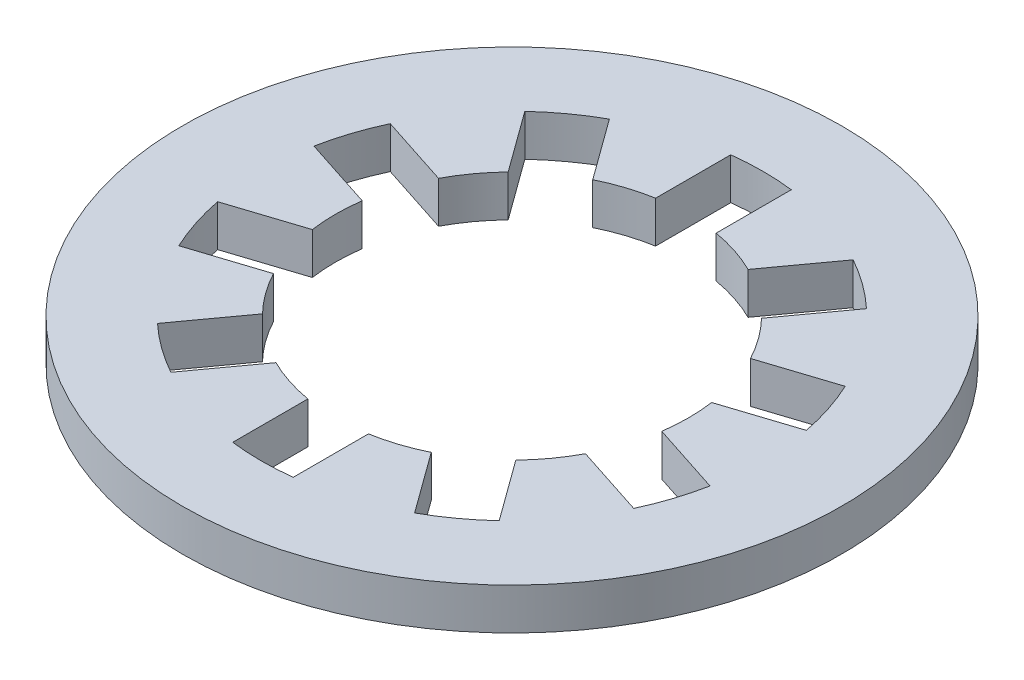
ISO-10303-21;
HEADER;
FILE_DESCRIPTION(('STEP AP214'),'2;1');
FILE_NAME('part.step','',(''),(''),'','','');
FILE_SCHEMA(('AUTOMOTIVE_DESIGN { 1 0 10303 214 1 1 1 1 }'));
ENDSEC;
DATA;
#1=APPLICATION_CONTEXT('core data for automotive mechanical design processes');
#2=APPLICATION_PROTOCOL_DEFINITION('international standard','automotive_design',2000,#1);
#3=PRODUCT_CONTEXT('',#1,'mechanical');
#4=PRODUCT('Part','Part','',(#3));
#5=PRODUCT_RELATED_PRODUCT_CATEGORY('part','',(#4));
#6=PRODUCT_DEFINITION_FORMATION('','',#4);
#7=PRODUCT_DEFINITION_CONTEXT('part definition',#1,'design');
#8=PRODUCT_DEFINITION('design','',#6,#7);
#9=PRODUCT_DEFINITION_SHAPE('','',#8);
#10=(LENGTH_UNIT() NAMED_UNIT(*) SI_UNIT(.MILLI.,.METRE.));
#11=(NAMED_UNIT(*) PLANE_ANGLE_UNIT() SI_UNIT($,.RADIAN.));
#12=(NAMED_UNIT(*) SI_UNIT($,.STERADIAN.) SOLID_ANGLE_UNIT());
#13=UNCERTAINTY_MEASURE_WITH_UNIT(LENGTH_MEASURE(1.E-05),#10,'distance_accuracy_value','');
#14=(GEOMETRIC_REPRESENTATION_CONTEXT(3) GLOBAL_UNCERTAINTY_ASSIGNED_CONTEXT((#13)) GLOBAL_UNIT_ASSIGNED_CONTEXT((#10,
#11,#12)) REPRESENTATION_CONTEXT('',''));
#15=CARTESIAN_POINT('',(0.,0.,0.));
#16=DIRECTION('',(0.,0.,1.));
#17=DIRECTION('',(1.,0.,0.));
#18=AXIS2_PLACEMENT_3D('',#15,#16,#17);
#19=CARTESIAN_POINT('',(0.,0.609600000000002,0.));
#20=DIRECTION('',(0.,-1.,0.));
#21=DIRECTION('',(0.,0.,-1.));
#22=AXIS2_PLACEMENT_3D('',#19,#20,#21);
#23=CYLINDRICAL_SURFACE('',#22,4.8387);
#24=CARTESIAN_POINT('',(0.,0.609600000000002,0.));
#25=DIRECTION('',(0.,1.,0.));
#26=DIRECTION('',(0.,0.,1.));
#27=AXIS2_PLACEMENT_3D('',#24,#25,#26);
#28=CIRCLE('',#27,4.8387);
#29=CARTESIAN_POINT('',(0.,0.609600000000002,4.8387));
#30=VERTEX_POINT('',#29);
#31=EDGE_CURVE('E11',#30,#30,#28,.T.);
#32=ORIENTED_EDGE('',*,*,#31,.F.);
#33=EDGE_LOOP('',(#32));
#34=FACE_BOUND('',#33,.T.);
#35=CARTESIAN_POINT('',(0.,0.,0.));
#36=DIRECTION('',(0.,1.,0.));
#37=DIRECTION('',(0.,0.,1.));
#38=AXIS2_PLACEMENT_3D('',#35,#36,#37);
#39=CIRCLE('',#38,4.8387);
#40=CARTESIAN_POINT('',(0.,0.,4.8387));
#41=VERTEX_POINT('',#40);
#42=EDGE_CURVE('E39',#41,#41,#39,.T.);
#43=ORIENTED_EDGE('',*,*,#42,.T.);
#44=EDGE_LOOP('',(#43));
#45=FACE_BOUND('',#44,.T.);
#46=ADVANCED_FACE('F36',(#34,#45),#23,.T.);
#47=CARTESIAN_POINT('',(0.,0.609600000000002,0.));
#48=DIRECTION('',(0.,1.,0.));
#49=DIRECTION('',(0.,0.,1.));
#50=AXIS2_PLACEMENT_3D('',#47,#48,#49);
#51=PLANE('',#50);
#52=CARTESIAN_POINT('',(0.,0.609600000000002,0.));
#53=DIRECTION('',(0.,1.,0.));
#54=DIRECTION('',(0.,0.,1.));
#55=AXIS2_PLACEMENT_3D('',#52,#53,#54);
#56=CIRCLE('',#55,2.5908);
#57=CARTESIAN_POINT('',(0.444499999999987,0.609600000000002,2.55238406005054));
#58=VERTEX_POINT('',#57);
#59=CARTESIAN_POINT('',(1.14064565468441,0.609600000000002,2.3261926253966));
#60=VERTEX_POINT('',#59);
#61=EDGE_CURVE('E295',#58,#60,#56,.T.);
#62=ORIENTED_EDGE('',*,*,#61,.F.);
#63=DIRECTION('',(0.,0.,-1.));
#64=VECTOR('',#63,1.);
#65=CARTESIAN_POINT('',(0.444499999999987,0.609600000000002,2.55238406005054));
#66=LINE('',#65,#64);
#67=CARTESIAN_POINT('',(0.444499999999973,0.609600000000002,3.65607832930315));
#68=VERTEX_POINT('',#67);
#69=EDGE_CURVE('E313',#68,#58,#66,.T.);
#70=ORIENTED_EDGE('',*,*,#69,.F.);
#71=CARTESIAN_POINT('',(0.,0.609600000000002,0.));
#72=DIRECTION('',(0.,1.,0.));
#73=DIRECTION('',(0.,0.,1.));
#74=AXIS2_PLACEMENT_3D('',#71,#72,#73);
#75=CIRCLE('',#74,3.683);
#76=CARTESIAN_POINT('',(-0.444500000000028,0.609600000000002,3.65607832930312));
#77=VERTEX_POINT('',#76);
#78=EDGE_CURVE('E324',#77,#68,#75,.T.);
#79=ORIENTED_EDGE('',*,*,#78,.F.);
#80=DIRECTION('',(0.,0.,1.));
#81=VECTOR('',#80,1.);
#82=CARTESIAN_POINT('',(-0.444500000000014,0.609600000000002,2.55238406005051));
#83=LINE('',#82,#81);
#84=CARTESIAN_POINT('',(-0.444500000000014,0.609600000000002,2.55238406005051));
#85=VERTEX_POINT('',#84);
#86=EDGE_CURVE('E331',#85,#77,#83,.T.);
#87=ORIENTED_EDGE('',*,*,#86,.F.);
#88=CARTESIAN_POINT('',(-1.14064565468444,0.609600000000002,2.3261926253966));
#89=VERTEX_POINT('',#88);
#90=EDGE_CURVE('E319',#89,#85,#56,.T.);
#91=ORIENTED_EDGE('',*,*,#90,.F.);
#92=DIRECTION('',(0.58778525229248,0.,-0.809016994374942));
#93=VECTOR('',#92,1.);
#94=CARTESIAN_POINT('',(-1.14064565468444,0.609600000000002,2.3261926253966));
#95=LINE('',#94,#93);
#96=CARTESIAN_POINT('',(-1.78938086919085,0.609600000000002,3.21910004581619));
#97=VERTEX_POINT('',#96);
#98=EDGE_CURVE('E677',#97,#89,#95,.T.);
#99=ORIENTED_EDGE('',*,*,#98,.F.);
#100=CARTESIAN_POINT('',(0.,0.609600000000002,0.));
#101=DIRECTION('',(0.,1.,0.));
#102=DIRECTION('',(0.,0.,1.));
#103=AXIS2_PLACEMENT_3D('',#100,#101,#102);
#104=CIRCLE('',#103,3.683);
#105=CARTESIAN_POINT('',(-2.50859697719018,0.609600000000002,2.69655895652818));
#106=VERTEX_POINT('',#105);
#107=EDGE_CURVE('E689',#106,#97,#104,.T.);
#108=ORIENTED_EDGE('',*,*,#107,.F.);
#109=DIRECTION('',(-0.58778525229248,0.,0.809016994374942));
#110=VECTOR('',#109,1.);
#111=CARTESIAN_POINT('',(-1.85986176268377,0.609600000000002,1.80365153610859));
#112=LINE('',#111,#110);
#113=CARTESIAN_POINT('',(-1.85986176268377,0.609600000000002,1.80365153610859));
#114=VERTEX_POINT('',#113);
#115=EDGE_CURVE('E662',#114,#106,#112,.T.);
#116=ORIENTED_EDGE('',*,*,#115,.F.);
#117=CARTESIAN_POINT('',(-2.29010343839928,0.609600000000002,1.21147467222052));
#118=VERTEX_POINT('',#117);
#119=EDGE_CURVE('E762',#118,#114,#56,.T.);
#120=ORIENTED_EDGE('',*,*,#119,.F.);
#121=DIRECTION('',(0.951056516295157,0.,-0.309016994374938));
#122=VECTOR('',#121,1.);
#123=CARTESIAN_POINT('',(-2.29010343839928,0.609600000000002,1.21147467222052));
#124=LINE('',#123,#122);
#125=CARTESIAN_POINT('',(-3.33977906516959,0.609600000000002,1.5525349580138));
#126=VERTEX_POINT('',#125);
#127=EDGE_CURVE('E640',#126,#118,#124,.T.);
#128=ORIENTED_EDGE('',*,*,#127,.F.);
#129=CARTESIAN_POINT('',(0.,0.609600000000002,0.));
#130=DIRECTION('',(0.,1.,0.));
#131=DIRECTION('',(0.,0.,1.));
#132=AXIS2_PLACEMENT_3D('',#129,#130,#131);
#133=CIRCLE('',#132,3.683);
#134=CARTESIAN_POINT('',(-3.61449517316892,0.609600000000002,0.707045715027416));
#135=VERTEX_POINT('',#134);
#136=EDGE_CURVE('E652',#135,#126,#133,.T.);
#137=ORIENTED_EDGE('',*,*,#136,.F.);
#138=DIRECTION('',(-0.951056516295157,0.,0.309016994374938));
#139=VECTOR('',#138,1.);
#140=CARTESIAN_POINT('',(-2.5648195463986,0.609600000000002,0.365985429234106));
#141=LINE('',#140,#139);
#142=CARTESIAN_POINT('',(-2.5648195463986,0.609600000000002,0.365985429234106));
#143=VERTEX_POINT('',#142);
#144=EDGE_CURVE('E625',#143,#135,#141,.T.);
#145=ORIENTED_EDGE('',*,*,#144,.F.);
#146=CARTESIAN_POINT('',(-2.56481954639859,0.609600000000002,-0.365985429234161));
#147=VERTEX_POINT('',#146);
#148=EDGE_CURVE('E757',#147,#143,#56,.T.);
#149=ORIENTED_EDGE('',*,*,#148,.F.);
#150=DIRECTION('',(0.95105651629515,0.,0.309016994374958));
#151=VECTOR('',#150,1.);
#152=CARTESIAN_POINT('',(-2.56481954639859,0.609600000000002,-0.365985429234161));
#153=LINE('',#152,#151);
#154=CARTESIAN_POINT('',(-3.61449517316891,0.609600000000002,-0.707045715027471));
#155=VERTEX_POINT('',#154);
#156=EDGE_CURVE('E603',#155,#147,#153,.T.);
#157=ORIENTED_EDGE('',*,*,#156,.F.);
#158=CARTESIAN_POINT('',(0.,0.609600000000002,0.));
#159=DIRECTION('',(0.,1.,0.));
#160=DIRECTION('',(0.,0.,1.));
#161=AXIS2_PLACEMENT_3D('',#158,#159,#160);
#162=CIRCLE('',#161,3.683);
#163=CARTESIAN_POINT('',(-3.33977906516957,0.609600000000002,-1.55253495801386));
#164=VERTEX_POINT('',#163);
#165=EDGE_CURVE('E615',#164,#155,#162,.T.);
#166=ORIENTED_EDGE('',*,*,#165,.F.);
#167=DIRECTION('',(-0.95105651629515,0.,-0.309016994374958));
#168=VECTOR('',#167,1.);
#169=CARTESIAN_POINT('',(-2.29010343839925,0.609600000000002,-1.21147467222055));
#170=LINE('',#169,#168);
#171=CARTESIAN_POINT('',(-2.29010343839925,0.609600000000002,-1.21147467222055));
#172=VERTEX_POINT('',#171);
#173=EDGE_CURVE('E589',#172,#164,#170,.T.);
#174=ORIENTED_EDGE('',*,*,#173,.F.);
#175=CARTESIAN_POINT('',(-1.85986176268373,0.609600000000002,-1.80365153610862));
#176=VERTEX_POINT('',#175);
#177=EDGE_CURVE('E761',#176,#172,#56,.T.);
#178=ORIENTED_EDGE('',*,*,#177,.F.);
#179=DIRECTION('',(0.587785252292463,0.,0.809016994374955));
#180=VECTOR('',#179,1.);
#181=CARTESIAN_POINT('',(-1.85986176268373,0.609600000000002,-1.80365153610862));
#182=LINE('',#181,#180);
#183=CARTESIAN_POINT('',(-2.50859697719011,0.609600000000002,-2.69655895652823));
#184=VERTEX_POINT('',#183);
#185=EDGE_CURVE('E568',#184,#176,#182,.T.);
#186=ORIENTED_EDGE('',*,*,#185,.F.);
#187=CARTESIAN_POINT('',(0.,0.609600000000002,0.));
#188=DIRECTION('',(0.,1.,0.));
#189=DIRECTION('',(0.,0.,1.));
#190=AXIS2_PLACEMENT_3D('',#187,#188,#189);
#191=CIRCLE('',#190,3.683);
#192=CARTESIAN_POINT('',(-1.78938086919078,0.609600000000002,-3.21910004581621));
#193=VERTEX_POINT('',#192);
#194=EDGE_CURVE('E579',#193,#184,#191,.T.);
#195=ORIENTED_EDGE('',*,*,#194,.F.);
#196=DIRECTION('',(-0.587785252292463,0.,-0.809016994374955));
#197=VECTOR('',#196,1.);
#198=CARTESIAN_POINT('',(-1.14064565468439,0.609600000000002,-2.32619262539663));
#199=LINE('',#198,#197);
#200=CARTESIAN_POINT('',(-1.14064565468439,0.609600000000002,-2.32619262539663));
#201=VERTEX_POINT('',#200);
#202=EDGE_CURVE('E562',#201,#193,#199,.T.);
#203=ORIENTED_EDGE('',*,*,#202,.F.);
#204=CARTESIAN_POINT('',(-0.4445,0.609600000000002,-2.55238406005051));
#205=VERTEX_POINT('',#204);
#206=EDGE_CURVE('E51',#205,#201,#56,.T.);
#207=ORIENTED_EDGE('',*,*,#206,.F.);
#208=DIRECTION('',(0.,0.,1.));
#209=VECTOR('',#208,1.);
#210=CARTESIAN_POINT('',(-0.4445,0.609600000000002,-2.55238406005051));
#211=LINE('',#210,#209);
#212=CARTESIAN_POINT('',(-0.4445,0.609600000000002,-3.65607832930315));
#213=VERTEX_POINT('',#212);
#214=EDGE_CURVE('E459',#213,#205,#211,.T.);
#215=ORIENTED_EDGE('',*,*,#214,.F.);
#216=CARTESIAN_POINT('',(0.,0.609600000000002,0.));
#217=DIRECTION('',(0.,1.,0.));
#218=DIRECTION('',(0.,0.,1.));
#219=AXIS2_PLACEMENT_3D('',#216,#217,#218);
#220=CIRCLE('',#219,3.683);
#221=CARTESIAN_POINT('',(0.4445,0.609600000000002,-3.65607832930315));
#222=VERTEX_POINT('',#221);
#223=EDGE_CURVE('E471',#222,#213,#220,.T.);
#224=ORIENTED_EDGE('',*,*,#223,.F.);
#225=DIRECTION('',(0.,0.,-1.));
#226=VECTOR('',#225,1.);
#227=CARTESIAN_POINT('',(0.4445,0.609600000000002,-2.55238406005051));
#228=LINE('',#227,#226);
#229=CARTESIAN_POINT('',(0.4445,0.609600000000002,-2.55238406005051));
#230=VERTEX_POINT('',#229);
#231=EDGE_CURVE('E444',#230,#222,#228,.T.);
#232=ORIENTED_EDGE('',*,*,#231,.F.);
#233=CARTESIAN_POINT('',(1.14064565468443,0.609600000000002,-2.3261926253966));
#234=VERTEX_POINT('',#233);
#235=EDGE_CURVE('E1212',#234,#230,#56,.T.);
#236=ORIENTED_EDGE('',*,*,#235,.F.);
#237=DIRECTION('',(-0.587785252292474,0.,0.809016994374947));
#238=VECTOR('',#237,1.);
#239=CARTESIAN_POINT('',(1.14064565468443,0.609600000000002,-2.3261926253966));
#240=LINE('',#239,#238);
#241=CARTESIAN_POINT('',(1.78938086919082,0.609600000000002,-3.21910004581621));
#242=VERTEX_POINT('',#241);
#243=EDGE_CURVE('E496',#242,#234,#240,.T.);
#244=ORIENTED_EDGE('',*,*,#243,.F.);
#245=CARTESIAN_POINT('',(0.,0.609600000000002,0.));
#246=DIRECTION('',(0.,1.,0.));
#247=DIRECTION('',(0.,0.,1.));
#248=AXIS2_PLACEMENT_3D('',#245,#246,#247);
#249=CIRCLE('',#248,3.683);
#250=CARTESIAN_POINT('',(2.50859697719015,0.609600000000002,-2.69655895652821));
#251=VERTEX_POINT('',#250);
#252=EDGE_CURVE('E508',#251,#242,#249,.T.);
#253=ORIENTED_EDGE('',*,*,#252,.F.);
#254=DIRECTION('',(0.587785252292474,0.,-0.809016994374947));
#255=VECTOR('',#254,1.);
#256=CARTESIAN_POINT('',(1.85986176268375,0.609600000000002,-1.80365153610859));
#257=LINE('',#256,#255);
#258=CARTESIAN_POINT('',(1.85986176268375,0.609600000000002,-1.80365153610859));
#259=VERTEX_POINT('',#258);
#260=EDGE_CURVE('E481',#259,#251,#257,.T.);
#261=ORIENTED_EDGE('',*,*,#260,.F.);
#262=CARTESIAN_POINT('',(2.29010343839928,0.609600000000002,-1.21147467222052));
#263=VERTEX_POINT('',#262);
#264=EDGE_CURVE('E536',#263,#259,#56,.T.);
#265=ORIENTED_EDGE('',*,*,#264,.F.);
#266=DIRECTION('',(-0.951056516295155,0.,0.309016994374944));
#267=VECTOR('',#266,1.);
#268=CARTESIAN_POINT('',(2.29010343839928,0.609600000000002,-1.21147467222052));
#269=LINE('',#268,#267);
#270=CARTESIAN_POINT('',(3.33977906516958,0.609600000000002,-1.55253495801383));
#271=VERTEX_POINT('',#270);
#272=EDGE_CURVE('E422',#271,#263,#269,.T.);
#273=ORIENTED_EDGE('',*,*,#272,.F.);
#274=CARTESIAN_POINT('',(0.,0.609600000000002,0.));
#275=DIRECTION('',(0.,1.,0.));
#276=DIRECTION('',(0.,0.,1.));
#277=AXIS2_PLACEMENT_3D('',#274,#275,#276);
#278=CIRCLE('',#277,3.683);
#279=CARTESIAN_POINT('',(3.61449517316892,0.609600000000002,-0.707045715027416));
#280=VERTEX_POINT('',#279);
#281=EDGE_CURVE('E434',#280,#271,#278,.T.);
#282=ORIENTED_EDGE('',*,*,#281,.F.);
#283=DIRECTION('',(0.951056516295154,0.,-0.309016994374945));
#284=VECTOR('',#283,1.);
#285=CARTESIAN_POINT('',(2.5648195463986,0.609600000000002,-0.365985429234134));
#286=LINE('',#285,#284);
#287=CARTESIAN_POINT('',(2.5648195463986,0.609600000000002,-0.365985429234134));
#288=VERTEX_POINT('',#287);
#289=EDGE_CURVE('E407',#288,#280,#286,.T.);
#290=ORIENTED_EDGE('',*,*,#289,.F.);
#291=CARTESIAN_POINT('',(2.56481954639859,0.609600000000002,0.365985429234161));
#292=VERTEX_POINT('',#291);
#293=EDGE_CURVE('E1226',#292,#288,#56,.T.);
#294=ORIENTED_EDGE('',*,*,#293,.F.);
#295=DIRECTION('',(-0.951056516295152,0.,-0.309016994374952));
#296=VECTOR('',#295,1.);
#297=CARTESIAN_POINT('',(2.56481954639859,0.609600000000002,0.365985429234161));
#298=LINE('',#297,#296);
#299=CARTESIAN_POINT('',(3.61449517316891,0.609600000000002,0.707045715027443));
#300=VERTEX_POINT('',#299);
#301=EDGE_CURVE('E385',#300,#292,#298,.T.);
#302=ORIENTED_EDGE('',*,*,#301,.F.);
#303=CARTESIAN_POINT('',(0.,0.609600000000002,0.));
#304=DIRECTION('',(0.,1.,0.));
#305=DIRECTION('',(0.,0.,1.));
#306=AXIS2_PLACEMENT_3D('',#303,#304,#305);
#307=CIRCLE('',#306,3.683);
#308=CARTESIAN_POINT('',(3.33977906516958,0.609600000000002,1.55253495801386));
#309=VERTEX_POINT('',#308);
#310=EDGE_CURVE('E397',#309,#300,#307,.T.);
#311=ORIENTED_EDGE('',*,*,#310,.F.);
#312=DIRECTION('',(0.951056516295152,0.,0.309016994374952));
#313=VECTOR('',#312,1.);
#314=CARTESIAN_POINT('',(2.29010343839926,0.609600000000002,1.21147467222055));
#315=LINE('',#314,#313);
#316=CARTESIAN_POINT('',(2.29010343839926,0.609600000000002,1.21147467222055));
#317=VERTEX_POINT('',#316);
#318=EDGE_CURVE('E371',#317,#309,#315,.T.);
#319=ORIENTED_EDGE('',*,*,#318,.F.);
#320=CARTESIAN_POINT('',(1.85986176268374,0.609600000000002,1.80365153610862));
#321=VERTEX_POINT('',#320);
#322=EDGE_CURVE('E317',#321,#317,#56,.T.);
#323=ORIENTED_EDGE('',*,*,#322,.F.);
#324=DIRECTION('',(-0.587785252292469,0.,-0.809016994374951));
#325=VECTOR('',#324,1.);
#326=CARTESIAN_POINT('',(1.85986176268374,0.609600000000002,1.80365153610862));
#327=LINE('',#326,#325);
#328=CARTESIAN_POINT('',(2.50859697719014,0.609600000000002,2.69655895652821));
#329=VERTEX_POINT('',#328);
#330=EDGE_CURVE('E350',#329,#321,#327,.T.);
#331=ORIENTED_EDGE('',*,*,#330,.F.);
#332=CARTESIAN_POINT('',(0.,0.609600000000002,0.));
#333=DIRECTION('',(0.,1.,0.));
#334=DIRECTION('',(0.,0.,1.));
#335=AXIS2_PLACEMENT_3D('',#332,#333,#334);
#336=CIRCLE('',#335,3.683);
#337=CARTESIAN_POINT('',(1.78938086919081,0.609600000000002,3.21910004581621));
#338=VERTEX_POINT('',#337);
#339=EDGE_CURVE('E361',#338,#329,#336,.T.);
#340=ORIENTED_EDGE('',*,*,#339,.F.);
#341=DIRECTION('',(0.587785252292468,0.,0.809016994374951));
#342=VECTOR('',#341,1.);
#343=CARTESIAN_POINT('',(1.14064565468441,0.609600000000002,2.3261926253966));
#344=LINE('',#343,#342);
#345=EDGE_CURVE('E304',#60,#338,#344,.T.);
#346=ORIENTED_EDGE('',*,*,#345,.F.);
#347=EDGE_LOOP('',(#62,#70,#79,#87,#91,#99,#108,#116,#120,#128,#137,#145,#149,#157,#166,#174,
#178,#186,#195,#203,#207,#215,#224,#232,#236,#244,#253,#261,#265,#273,#282,#290,#294,#302,#311,
#319,#323,#331,#340,#346));
#348=FACE_BOUND('',#347,.T.);
#349=ORIENTED_EDGE('',*,*,#31,.T.);
#350=EDGE_LOOP('',(#349));
#351=FACE_BOUND('',#350,.T.);
#352=ADVANCED_FACE('F310',(#348,#351),#51,.T.);
#353=CARTESIAN_POINT('',(0.,0.,0.));
#354=DIRECTION('',(0.,1.,0.));
#355=DIRECTION('',(0.,0.,1.));
#356=AXIS2_PLACEMENT_3D('',#353,#354,#355);
#357=PLANE('',#356);
#358=DIRECTION('',(0.,0.,-1.));
#359=VECTOR('',#358,1.);
#360=CARTESIAN_POINT('',(0.444499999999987,0.,2.55238406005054));
#361=LINE('',#360,#359);
#362=CARTESIAN_POINT('',(0.444499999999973,0.,3.65607832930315));
#363=VERTEX_POINT('',#362);
#364=CARTESIAN_POINT('',(0.444499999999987,0.,2.55238406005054));
#365=VERTEX_POINT('',#364);
#366=EDGE_CURVE('E344',#363,#365,#361,.T.);
#367=ORIENTED_EDGE('',*,*,#366,.T.);
#368=CARTESIAN_POINT('',(0.,0.,0.));
#369=DIRECTION('',(0.,1.,0.));
#370=DIRECTION('',(0.,0.,1.));
#371=AXIS2_PLACEMENT_3D('',#368,#369,#370);
#372=CIRCLE('',#371,2.5908);
#373=CARTESIAN_POINT('',(1.14064565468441,0.,2.3261926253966));
#374=VERTEX_POINT('',#373);
#375=EDGE_CURVE('E298',#365,#374,#372,.T.);
#376=ORIENTED_EDGE('',*,*,#375,.T.);
#377=DIRECTION('',(0.587785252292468,0.,0.809016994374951));
#378=VECTOR('',#377,1.);
#379=CARTESIAN_POINT('',(1.14064565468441,0.,2.3261926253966));
#380=LINE('',#379,#378);
#381=CARTESIAN_POINT('',(1.78938086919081,0.,3.21910004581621));
#382=VERTEX_POINT('',#381);
#383=EDGE_CURVE('E345',#374,#382,#380,.T.);
#384=ORIENTED_EDGE('',*,*,#383,.T.);
#385=CARTESIAN_POINT('',(0.,0.,0.));
#386=DIRECTION('',(0.,1.,0.));
#387=DIRECTION('',(0.,0.,1.));
#388=AXIS2_PLACEMENT_3D('',#385,#386,#387);
#389=CIRCLE('',#388,3.683);
#390=CARTESIAN_POINT('',(2.50859697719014,0.,2.69655895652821));
#391=VERTEX_POINT('',#390);
#392=EDGE_CURVE('E349',#382,#391,#389,.T.);
#393=ORIENTED_EDGE('',*,*,#392,.T.);
#394=DIRECTION('',(-0.587785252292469,0.,-0.809016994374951));
#395=VECTOR('',#394,1.);
#396=CARTESIAN_POINT('',(1.85986176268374,0.,1.80365153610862));
#397=LINE('',#396,#395);
#398=CARTESIAN_POINT('',(1.85986176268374,0.,1.80365153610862));
#399=VERTEX_POINT('',#398);
#400=EDGE_CURVE('E354',#391,#399,#397,.T.);
#401=ORIENTED_EDGE('',*,*,#400,.T.);
#402=CARTESIAN_POINT('',(2.29010343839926,0.,1.21147467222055));
#403=VERTEX_POINT('',#402);
#404=EDGE_CURVE('E557',#399,#403,#372,.T.);
#405=ORIENTED_EDGE('',*,*,#404,.T.);
#406=DIRECTION('',(0.951056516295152,0.,0.309016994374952));
#407=VECTOR('',#406,1.);
#408=CARTESIAN_POINT('',(2.29010343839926,0.,1.21147467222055));
#409=LINE('',#408,#407);
#410=CARTESIAN_POINT('',(3.33977906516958,0.,1.55253495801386));
#411=VERTEX_POINT('',#410);
#412=EDGE_CURVE('E380',#403,#411,#409,.T.);
#413=ORIENTED_EDGE('',*,*,#412,.T.);
#414=CARTESIAN_POINT('',(0.,0.,0.));
#415=DIRECTION('',(0.,1.,0.));
#416=DIRECTION('',(0.,0.,1.));
#417=AXIS2_PLACEMENT_3D('',#414,#415,#416);
#418=CIRCLE('',#417,3.683);
#419=CARTESIAN_POINT('',(3.61449517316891,0.,0.707045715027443));
#420=VERTEX_POINT('',#419);
#421=EDGE_CURVE('E384',#411,#420,#418,.T.);
#422=ORIENTED_EDGE('',*,*,#421,.T.);
#423=DIRECTION('',(-0.951056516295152,0.,-0.309016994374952));
#424=VECTOR('',#423,1.);
#425=CARTESIAN_POINT('',(2.56481954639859,0.,0.365985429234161));
#426=LINE('',#425,#424);
#427=CARTESIAN_POINT('',(2.56481954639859,0.,0.365985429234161));
#428=VERTEX_POINT('',#427);
#429=EDGE_CURVE('E389',#420,#428,#426,.T.);
#430=ORIENTED_EDGE('',*,*,#429,.T.);
#431=CARTESIAN_POINT('',(2.56481954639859,0.,-0.365985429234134));
#432=VERTEX_POINT('',#431);
#433=EDGE_CURVE('E550',#428,#432,#372,.T.);
#434=ORIENTED_EDGE('',*,*,#433,.T.);
#435=DIRECTION('',(0.951056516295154,0.,-0.309016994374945));
#436=VECTOR('',#435,1.);
#437=CARTESIAN_POINT('',(2.5648195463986,0.,-0.365985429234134));
#438=LINE('',#437,#436);
#439=CARTESIAN_POINT('',(3.61449517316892,0.,-0.707045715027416));
#440=VERTEX_POINT('',#439);
#441=EDGE_CURVE('E417',#432,#440,#438,.T.);
#442=ORIENTED_EDGE('',*,*,#441,.T.);
#443=CARTESIAN_POINT('',(0.,0.,0.));
#444=DIRECTION('',(0.,1.,0.));
#445=DIRECTION('',(0.,0.,1.));
#446=AXIS2_PLACEMENT_3D('',#443,#444,#445);
#447=CIRCLE('',#446,3.683);
#448=CARTESIAN_POINT('',(3.33977906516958,0.,-1.55253495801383));
#449=VERTEX_POINT('',#448);
#450=EDGE_CURVE('E421',#440,#449,#447,.T.);
#451=ORIENTED_EDGE('',*,*,#450,.T.);
#452=DIRECTION('',(-0.951056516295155,0.,0.309016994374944));
#453=VECTOR('',#452,1.);
#454=CARTESIAN_POINT('',(2.29010343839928,0.,-1.21147467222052));
#455=LINE('',#454,#453);
#456=CARTESIAN_POINT('',(2.29010343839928,0.,-1.21147467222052));
#457=VERTEX_POINT('',#456);
#458=EDGE_CURVE('E426',#449,#457,#455,.T.);
#459=ORIENTED_EDGE('',*,*,#458,.T.);
#460=CARTESIAN_POINT('',(1.85986176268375,0.,-1.80365153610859));
#461=VERTEX_POINT('',#460);
#462=EDGE_CURVE('E545',#457,#461,#372,.T.);
#463=ORIENTED_EDGE('',*,*,#462,.T.);
#464=DIRECTION('',(0.587785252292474,0.,-0.809016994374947));
#465=VECTOR('',#464,1.);
#466=CARTESIAN_POINT('',(1.85986176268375,0.,-1.80365153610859));
#467=LINE('',#466,#465);
#468=CARTESIAN_POINT('',(2.50859697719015,0.,-2.69655895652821));
#469=VERTEX_POINT('',#468);
#470=EDGE_CURVE('E491',#461,#469,#467,.T.);
#471=ORIENTED_EDGE('',*,*,#470,.T.);
#472=CARTESIAN_POINT('',(0.,0.,0.));
#473=DIRECTION('',(0.,1.,0.));
#474=DIRECTION('',(0.,0.,1.));
#475=AXIS2_PLACEMENT_3D('',#472,#473,#474);
#476=CIRCLE('',#475,3.683);
#477=CARTESIAN_POINT('',(1.78938086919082,0.,-3.21910004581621));
#478=VERTEX_POINT('',#477);
#479=EDGE_CURVE('E495',#469,#478,#476,.T.);
#480=ORIENTED_EDGE('',*,*,#479,.T.);
#481=DIRECTION('',(-0.587785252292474,0.,0.809016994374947));
#482=VECTOR('',#481,1.);
#483=CARTESIAN_POINT('',(1.14064565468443,0.,-2.3261926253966));
#484=LINE('',#483,#482);
#485=CARTESIAN_POINT('',(1.14064565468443,0.,-2.3261926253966));
#486=VERTEX_POINT('',#485);
#487=EDGE_CURVE('E500',#478,#486,#484,.T.);
#488=ORIENTED_EDGE('',*,*,#487,.T.);
#489=CARTESIAN_POINT('',(0.4445,0.,-2.55238406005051));
#490=VERTEX_POINT('',#489);
#491=EDGE_CURVE('E549',#486,#490,#372,.T.);
#492=ORIENTED_EDGE('',*,*,#491,.T.);
#493=DIRECTION('',(0.,0.,-1.));
#494=VECTOR('',#493,1.);
#495=CARTESIAN_POINT('',(0.4445,0.,-2.55238406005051));
#496=LINE('',#495,#494);
#497=CARTESIAN_POINT('',(0.4445,0.,-3.65607832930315));
#498=VERTEX_POINT('',#497);
#499=EDGE_CURVE('E454',#490,#498,#496,.T.);
#500=ORIENTED_EDGE('',*,*,#499,.T.);
#501=CARTESIAN_POINT('',(0.,0.,0.));
#502=DIRECTION('',(0.,1.,0.));
#503=DIRECTION('',(0.,0.,1.));
#504=AXIS2_PLACEMENT_3D('',#501,#502,#503);
#505=CIRCLE('',#504,3.683);
#506=CARTESIAN_POINT('',(-0.4445,0.,-3.65607832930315));
#507=VERTEX_POINT('',#506);
#508=EDGE_CURVE('E458',#498,#507,#505,.T.);
#509=ORIENTED_EDGE('',*,*,#508,.T.);
#510=DIRECTION('',(0.,0.,1.));
#511=VECTOR('',#510,1.);
#512=CARTESIAN_POINT('',(-0.4445,0.,-2.55238406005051));
#513=LINE('',#512,#511);
#514=CARTESIAN_POINT('',(-0.4445,0.,-2.55238406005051));
#515=VERTEX_POINT('',#514);
#516=EDGE_CURVE('E463',#507,#515,#513,.T.);
#517=ORIENTED_EDGE('',*,*,#516,.T.);
#518=CARTESIAN_POINT('',(-1.14064565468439,0.,-2.32619262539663));
#519=VERTEX_POINT('',#518);
#520=EDGE_CURVE('E558',#515,#519,#372,.T.);
#521=ORIENTED_EDGE('',*,*,#520,.T.);
#522=DIRECTION('',(-0.587785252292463,0.,-0.809016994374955));
#523=VECTOR('',#522,1.);
#524=CARTESIAN_POINT('',(-1.14064565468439,0.,-2.32619262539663));
#525=LINE('',#524,#523);
#526=CARTESIAN_POINT('',(-1.78938086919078,0.,-3.21910004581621));
#527=VERTEX_POINT('',#526);
#528=EDGE_CURVE('E564',#519,#527,#525,.T.);
#529=ORIENTED_EDGE('',*,*,#528,.T.);
#530=CARTESIAN_POINT('',(0.,0.,0.));
#531=DIRECTION('',(0.,1.,0.));
#532=DIRECTION('',(0.,0.,1.));
#533=AXIS2_PLACEMENT_3D('',#530,#531,#532);
#534=CIRCLE('',#533,3.683);
#535=CARTESIAN_POINT('',(-2.50859697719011,0.,-2.69655895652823));
#536=VERTEX_POINT('',#535);
#537=EDGE_CURVE('E59',#527,#536,#534,.T.);
#538=ORIENTED_EDGE('',*,*,#537,.T.);
#539=DIRECTION('',(0.587785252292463,0.,0.809016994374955));
#540=VECTOR('',#539,1.);
#541=CARTESIAN_POINT('',(-1.85986176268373,0.,-1.80365153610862));
#542=LINE('',#541,#540);
#543=CARTESIAN_POINT('',(-1.85986176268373,0.,-1.80365153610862));
#544=VERTEX_POINT('',#543);
#545=EDGE_CURVE('E571',#536,#544,#542,.T.);
#546=ORIENTED_EDGE('',*,*,#545,.T.);
#547=CARTESIAN_POINT('',(-2.29010343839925,0.,-1.21147467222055));
#548=VERTEX_POINT('',#547);
#549=EDGE_CURVE('E563',#544,#548,#372,.T.);
#550=ORIENTED_EDGE('',*,*,#549,.T.);
#551=DIRECTION('',(-0.95105651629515,0.,-0.309016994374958));
#552=VECTOR('',#551,1.);
#553=CARTESIAN_POINT('',(-2.29010343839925,0.,-1.21147467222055));
#554=LINE('',#553,#552);
#555=CARTESIAN_POINT('',(-3.33977906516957,0.,-1.55253495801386));
#556=VERTEX_POINT('',#555);
#557=EDGE_CURVE('E598',#548,#556,#554,.T.);
#558=ORIENTED_EDGE('',*,*,#557,.T.);
#559=CARTESIAN_POINT('',(0.,0.,0.));
#560=DIRECTION('',(0.,1.,0.));
#561=DIRECTION('',(0.,0.,1.));
#562=AXIS2_PLACEMENT_3D('',#559,#560,#561);
#563=CIRCLE('',#562,3.683);
#564=CARTESIAN_POINT('',(-3.61449517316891,0.,-0.707045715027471));
#565=VERTEX_POINT('',#564);
#566=EDGE_CURVE('E602',#556,#565,#563,.T.);
#567=ORIENTED_EDGE('',*,*,#566,.T.);
#568=DIRECTION('',(0.95105651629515,0.,0.309016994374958));
#569=VECTOR('',#568,1.);
#570=CARTESIAN_POINT('',(-2.56481954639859,0.,-0.365985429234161));
#571=LINE('',#570,#569);
#572=CARTESIAN_POINT('',(-2.56481954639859,0.,-0.365985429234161));
#573=VERTEX_POINT('',#572);
#574=EDGE_CURVE('E607',#565,#573,#571,.T.);
#575=ORIENTED_EDGE('',*,*,#574,.T.);
#576=CARTESIAN_POINT('',(-2.5648195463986,0.,0.365985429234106));
#577=VERTEX_POINT('',#576);
#578=EDGE_CURVE('E731',#573,#577,#372,.T.);
#579=ORIENTED_EDGE('',*,*,#578,.T.);
#580=DIRECTION('',(-0.951056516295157,0.,0.309016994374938));
#581=VECTOR('',#580,1.);
#582=CARTESIAN_POINT('',(-2.5648195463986,0.,0.365985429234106));
#583=LINE('',#582,#581);
#584=CARTESIAN_POINT('',(-3.61449517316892,0.,0.707045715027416));
#585=VERTEX_POINT('',#584);
#586=EDGE_CURVE('E635',#577,#585,#583,.T.);
#587=ORIENTED_EDGE('',*,*,#586,.T.);
#588=CARTESIAN_POINT('',(0.,0.,0.));
#589=DIRECTION('',(0.,1.,0.));
#590=DIRECTION('',(0.,0.,1.));
#591=AXIS2_PLACEMENT_3D('',#588,#589,#590);
#592=CIRCLE('',#591,3.683);
#593=CARTESIAN_POINT('',(-3.33977906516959,0.,1.5525349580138));
#594=VERTEX_POINT('',#593);
#595=EDGE_CURVE('E639',#585,#594,#592,.T.);
#596=ORIENTED_EDGE('',*,*,#595,.T.);
#597=DIRECTION('',(0.951056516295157,0.,-0.309016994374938));
#598=VECTOR('',#597,1.);
#599=CARTESIAN_POINT('',(-2.29010343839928,0.,1.21147467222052));
#600=LINE('',#599,#598);
#601=CARTESIAN_POINT('',(-2.29010343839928,0.,1.21147467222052));
#602=VERTEX_POINT('',#601);
#603=EDGE_CURVE('E644',#594,#602,#600,.T.);
#604=ORIENTED_EDGE('',*,*,#603,.T.);
#605=CARTESIAN_POINT('',(-1.85986176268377,0.,1.80365153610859));
#606=VERTEX_POINT('',#605);
#607=EDGE_CURVE('E728',#602,#606,#372,.T.);
#608=ORIENTED_EDGE('',*,*,#607,.T.);
#609=DIRECTION('',(-0.58778525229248,0.,0.809016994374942));
#610=VECTOR('',#609,1.);
#611=CARTESIAN_POINT('',(-1.85986176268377,0.,1.80365153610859));
#612=LINE('',#611,#610);
#613=CARTESIAN_POINT('',(-2.50859697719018,0.,2.69655895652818));
#614=VERTEX_POINT('',#613);
#615=EDGE_CURVE('E672',#606,#614,#612,.T.);
#616=ORIENTED_EDGE('',*,*,#615,.T.);
#617=CARTESIAN_POINT('',(0.,0.,0.));
#618=DIRECTION('',(0.,1.,0.));
#619=DIRECTION('',(0.,0.,1.));
#620=AXIS2_PLACEMENT_3D('',#617,#618,#619);
#621=CIRCLE('',#620,3.683);
#622=CARTESIAN_POINT('',(-1.78938086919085,0.,3.21910004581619));
#623=VERTEX_POINT('',#622);
#624=EDGE_CURVE('E676',#614,#623,#621,.T.);
#625=ORIENTED_EDGE('',*,*,#624,.T.);
#626=DIRECTION('',(0.58778525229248,0.,-0.809016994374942));
#627=VECTOR('',#626,1.);
#628=CARTESIAN_POINT('',(-1.14064565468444,0.,2.3261926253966));
#629=LINE('',#628,#627);
#630=CARTESIAN_POINT('',(-1.14064565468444,0.,2.3261926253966));
#631=VERTEX_POINT('',#630);
#632=EDGE_CURVE('E681',#623,#631,#629,.T.);
#633=ORIENTED_EDGE('',*,*,#632,.T.);
#634=CARTESIAN_POINT('',(-0.444500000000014,0.,2.55238406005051));
#635=VERTEX_POINT('',#634);
#636=EDGE_CURVE('E554',#631,#635,#372,.T.);
#637=ORIENTED_EDGE('',*,*,#636,.T.);
#638=DIRECTION('',(0.,0.,1.));
#639=VECTOR('',#638,1.);
#640=CARTESIAN_POINT('',(-0.444500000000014,0.,2.55238406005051));
#641=LINE('',#640,#639);
#642=CARTESIAN_POINT('',(-0.444500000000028,0.,3.65607832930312));
#643=VERTEX_POINT('',#642);
#644=EDGE_CURVE('E323',#635,#643,#641,.T.);
#645=ORIENTED_EDGE('',*,*,#644,.T.);
#646=CARTESIAN_POINT('',(0.,0.,0.));
#647=DIRECTION('',(0.,1.,0.));
#648=DIRECTION('',(0.,0.,1.));
#649=AXIS2_PLACEMENT_3D('',#646,#647,#648);
#650=CIRCLE('',#649,3.683);
#651=EDGE_CURVE('E329',#643,#363,#650,.T.);
#652=ORIENTED_EDGE('',*,*,#651,.T.);
#653=EDGE_LOOP('',(#367,#376,#384,#393,#401,#405,#413,#422,#430,#434,#442,#451,#459,#463,#471,
#480,#488,#492,#500,#509,#517,#521,#529,#538,#546,#550,#558,#567,#575,#579,#587,#596,#604,#608,
#616,#625,#633,#637,#645,#652));
#654=FACE_BOUND('',#653,.T.);
#655=ORIENTED_EDGE('',*,*,#42,.F.);
#656=EDGE_LOOP('',(#655));
#657=FACE_BOUND('',#656,.T.);
#658=ADVANCED_FACE('F543',(#654,#657),#357,.F.);
#659=CARTESIAN_POINT('',(1.14064565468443,0.,-2.3261926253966));
#660=DIRECTION('',(-0.809016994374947,0.,-0.587785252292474));
#661=DIRECTION('',(-0.587785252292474,0.,0.809016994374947));
#662=AXIS2_PLACEMENT_3D('',#659,#660,#661);
#663=PLANE('',#662);
#664=ORIENTED_EDGE('',*,*,#243,.T.);
#665=DIRECTION('',(0.,1.,0.));
#666=VECTOR('',#665,1.);
#667=CARTESIAN_POINT('',(1.14064565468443,0.,-2.3261926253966));
#668=LINE('',#667,#666);
#669=EDGE_CURVE('E515',#486,#234,#668,.T.);
#670=ORIENTED_EDGE('',*,*,#669,.F.);
#671=ORIENTED_EDGE('',*,*,#487,.F.);
#672=DIRECTION('',(0.,1.,0.));
#673=VECTOR('',#672,1.);
#674=CARTESIAN_POINT('',(1.78938086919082,0.,-3.21910004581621));
#675=LINE('',#674,#673);
#676=EDGE_CURVE('E518',#478,#242,#675,.T.);
#677=ORIENTED_EDGE('',*,*,#676,.T.);
#678=EDGE_LOOP('',(#664,#670,#671,#677));
#679=FACE_BOUND('',#678,.T.);
#680=ADVANCED_FACE('F810',(#679),#663,.F.);
#681=CARTESIAN_POINT('',(0.,0.,0.));
#682=DIRECTION('',(0.,1.,0.));
#683=DIRECTION('',(0.,0.,1.));
#684=AXIS2_PLACEMENT_3D('',#681,#682,#683);
#685=CYLINDRICAL_SURFACE('',#684,3.683);
#686=ORIENTED_EDGE('',*,*,#252,.T.);
#687=ORIENTED_EDGE('',*,*,#676,.F.);
#688=ORIENTED_EDGE('',*,*,#479,.F.);
#689=DIRECTION('',(0.,1.,0.));
#690=VECTOR('',#689,1.);
#691=CARTESIAN_POINT('',(2.50859697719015,0.,-2.69655895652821));
#692=LINE('',#691,#690);
#693=EDGE_CURVE('E521',#469,#251,#692,.T.);
#694=ORIENTED_EDGE('',*,*,#693,.T.);
#695=EDGE_LOOP('',(#686,#687,#688,#694));
#696=FACE_BOUND('',#695,.T.);
#697=ADVANCED_FACE('F540',(#696),#685,.F.);
#698=CARTESIAN_POINT('',(1.85986176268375,0.,-1.80365153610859));
#699=DIRECTION('',(0.809016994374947,0.,0.587785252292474));
#700=DIRECTION('',(0.587785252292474,0.,-0.809016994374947));
#701=AXIS2_PLACEMENT_3D('',#698,#699,#700);
#702=PLANE('',#701);
#703=ORIENTED_EDGE('',*,*,#260,.T.);
#704=ORIENTED_EDGE('',*,*,#693,.F.);
#705=ORIENTED_EDGE('',*,*,#470,.F.);
#706=DIRECTION('',(0.,1.,0.));
#707=VECTOR('',#706,1.);
#708=CARTESIAN_POINT('',(1.85986176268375,0.,-1.80365153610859));
#709=LINE('',#708,#707);
#710=EDGE_CURVE('E504',#461,#259,#709,.T.);
#711=ORIENTED_EDGE('',*,*,#710,.T.);
#712=EDGE_LOOP('',(#703,#704,#705,#711));
#713=FACE_BOUND('',#712,.T.);
#714=ADVANCED_FACE('F529',(#713),#702,.F.);
#715=CARTESIAN_POINT('',(-0.4445,0.,-2.55238406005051));
#716=DIRECTION('',(-1.,0.,0.));
#717=DIRECTION('',(0.,0.,1.));
#718=AXIS2_PLACEMENT_3D('',#715,#716,#717);
#719=PLANE('',#718);
#720=ORIENTED_EDGE('',*,*,#214,.T.);
#721=DIRECTION('',(0.,1.,0.));
#722=VECTOR('',#721,1.);
#723=CARTESIAN_POINT('',(-0.4445,0.,-2.55238406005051));
#724=LINE('',#723,#722);
#725=EDGE_CURVE('E478',#515,#205,#724,.T.);
#726=ORIENTED_EDGE('',*,*,#725,.F.);
#727=ORIENTED_EDGE('',*,*,#516,.F.);
#728=DIRECTION('',(0.,1.,0.));
#729=VECTOR('',#728,1.);
#730=CARTESIAN_POINT('',(-0.4445,0.,-3.65607832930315));
#731=LINE('',#730,#729);
#732=EDGE_CURVE('E482',#507,#213,#731,.T.);
#733=ORIENTED_EDGE('',*,*,#732,.T.);
#734=EDGE_LOOP('',(#720,#726,#727,#733));
#735=FACE_BOUND('',#734,.T.);
#736=ADVANCED_FACE('F819',(#735),#719,.F.);
#737=CARTESIAN_POINT('',(0.,0.,0.));
#738=DIRECTION('',(0.,1.,0.));
#739=DIRECTION('',(0.,0.,1.));
#740=AXIS2_PLACEMENT_3D('',#737,#738,#739);
#741=CYLINDRICAL_SURFACE('',#740,3.683);
#742=ORIENTED_EDGE('',*,*,#223,.T.);
#743=ORIENTED_EDGE('',*,*,#732,.F.);
#744=ORIENTED_EDGE('',*,*,#508,.F.);
#745=DIRECTION('',(0.,1.,0.));
#746=VECTOR('',#745,1.);
#747=CARTESIAN_POINT('',(0.4445,0.,-3.65607832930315));
#748=LINE('',#747,#746);
#749=EDGE_CURVE('E485',#498,#222,#748,.T.);
#750=ORIENTED_EDGE('',*,*,#749,.T.);
#751=EDGE_LOOP('',(#742,#743,#744,#750));
#752=FACE_BOUND('',#751,.T.);
#753=ADVANCED_FACE('F826',(#752),#741,.F.);
#754=CARTESIAN_POINT('',(0.4445,0.,-2.55238406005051));
#755=DIRECTION('',(1.,0.,0.));
#756=DIRECTION('',(0.,0.,-1.));
#757=AXIS2_PLACEMENT_3D('',#754,#755,#756);
#758=PLANE('',#757);
#759=ORIENTED_EDGE('',*,*,#231,.T.);
#760=ORIENTED_EDGE('',*,*,#749,.F.);
#761=ORIENTED_EDGE('',*,*,#499,.F.);
#762=DIRECTION('',(0.,1.,0.));
#763=VECTOR('',#762,1.);
#764=CARTESIAN_POINT('',(0.4445,0.,-2.55238406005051));
#765=LINE('',#764,#763);
#766=EDGE_CURVE('E467',#490,#230,#765,.T.);
#767=ORIENTED_EDGE('',*,*,#766,.T.);
#768=EDGE_LOOP('',(#759,#760,#761,#767));
#769=FACE_BOUND('',#768,.T.);
#770=ADVANCED_FACE('F822',(#769),#758,.F.);
#771=CARTESIAN_POINT('',(2.29010343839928,0.,-1.21147467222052));
#772=DIRECTION('',(-0.309016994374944,0.,-0.951056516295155));
#773=DIRECTION('',(-0.951056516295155,0.,0.309016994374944));
#774=AXIS2_PLACEMENT_3D('',#771,#772,#773);
#775=PLANE('',#774);
#776=ORIENTED_EDGE('',*,*,#272,.T.);
#777=DIRECTION('',(0.,1.,0.));
#778=VECTOR('',#777,1.);
#779=CARTESIAN_POINT('',(2.29010343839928,0.,-1.21147467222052));
#780=LINE('',#779,#778);
#781=EDGE_CURVE('E441',#457,#263,#780,.T.);
#782=ORIENTED_EDGE('',*,*,#781,.F.);
#783=ORIENTED_EDGE('',*,*,#458,.F.);
#784=DIRECTION('',(0.,1.,0.));
#785=VECTOR('',#784,1.);
#786=CARTESIAN_POINT('',(3.33977906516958,0.,-1.55253495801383));
#787=LINE('',#786,#785);
#788=EDGE_CURVE('E445',#449,#271,#787,.T.);
#789=ORIENTED_EDGE('',*,*,#788,.T.);
#790=EDGE_LOOP('',(#776,#782,#783,#789));
#791=FACE_BOUND('',#790,.T.);
#792=ADVANCED_FACE('F825',(#791),#775,.F.);
#793=CARTESIAN_POINT('',(0.,0.,0.));
#794=DIRECTION('',(0.,1.,0.));
#795=DIRECTION('',(0.,0.,1.));
#796=AXIS2_PLACEMENT_3D('',#793,#794,#795);
#797=CYLINDRICAL_SURFACE('',#796,3.683);
#798=ORIENTED_EDGE('',*,*,#281,.T.);
#799=ORIENTED_EDGE('',*,*,#788,.F.);
#800=ORIENTED_EDGE('',*,*,#450,.F.);
#801=DIRECTION('',(0.,1.,0.));
#802=VECTOR('',#801,1.);
#803=CARTESIAN_POINT('',(3.61449517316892,0.,-0.707045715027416));
#804=LINE('',#803,#802);
#805=EDGE_CURVE('E448',#440,#280,#804,.T.);
#806=ORIENTED_EDGE('',*,*,#805,.T.);
#807=EDGE_LOOP('',(#798,#799,#800,#806));
#808=FACE_BOUND('',#807,.T.);
#809=ADVANCED_FACE('F838',(#808),#797,.F.);
#810=CARTESIAN_POINT('',(2.5648195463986,0.,-0.365985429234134));
#811=DIRECTION('',(0.309016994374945,0.,0.951056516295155));
#812=DIRECTION('',(0.951056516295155,0.,-0.309016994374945));
#813=AXIS2_PLACEMENT_3D('',#810,#811,#812);
#814=PLANE('',#813);
#815=ORIENTED_EDGE('',*,*,#289,.T.);
#816=ORIENTED_EDGE('',*,*,#805,.F.);
#817=ORIENTED_EDGE('',*,*,#441,.F.);
#818=DIRECTION('',(0.,1.,0.));
#819=VECTOR('',#818,1.);
#820=CARTESIAN_POINT('',(2.5648195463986,0.,-0.365985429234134));
#821=LINE('',#820,#819);
#822=EDGE_CURVE('E430',#432,#288,#821,.T.);
#823=ORIENTED_EDGE('',*,*,#822,.T.);
#824=EDGE_LOOP('',(#815,#816,#817,#823));
#825=FACE_BOUND('',#824,.T.);
#826=ADVANCED_FACE('F834',(#825),#814,.F.);
#827=CARTESIAN_POINT('',(2.56481954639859,0.,0.365985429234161));
#828=DIRECTION('',(0.309016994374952,0.,-0.951056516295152));
#829=DIRECTION('',(-0.951056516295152,0.,-0.309016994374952));
#830=AXIS2_PLACEMENT_3D('',#827,#828,#829);
#831=PLANE('',#830);
#832=ORIENTED_EDGE('',*,*,#301,.T.);
#833=DIRECTION('',(0.,1.,0.));
#834=VECTOR('',#833,1.);
#835=CARTESIAN_POINT('',(2.56481954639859,0.,0.365985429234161));
#836=LINE('',#835,#834);
#837=EDGE_CURVE('E404',#428,#292,#836,.T.);
#838=ORIENTED_EDGE('',*,*,#837,.F.);
#839=ORIENTED_EDGE('',*,*,#429,.F.);
#840=DIRECTION('',(0.,1.,0.));
#841=VECTOR('',#840,1.);
#842=CARTESIAN_POINT('',(3.61449517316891,0.,0.707045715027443));
#843=LINE('',#842,#841);
#844=EDGE_CURVE('E408',#420,#300,#843,.T.);
#845=ORIENTED_EDGE('',*,*,#844,.T.);
#846=EDGE_LOOP('',(#832,#838,#839,#845));
#847=FACE_BOUND('',#846,.T.);
#848=ADVANCED_FACE('F837',(#847),#831,.F.);
#849=CARTESIAN_POINT('',(0.,0.,0.));
#850=DIRECTION('',(0.,1.,0.));
#851=DIRECTION('',(0.,0.,1.));
#852=AXIS2_PLACEMENT_3D('',#849,#850,#851);
#853=CYLINDRICAL_SURFACE('',#852,3.683);
#854=ORIENTED_EDGE('',*,*,#310,.T.);
#855=ORIENTED_EDGE('',*,*,#844,.F.);
#856=ORIENTED_EDGE('',*,*,#421,.F.);
#857=DIRECTION('',(0.,1.,0.));
#858=VECTOR('',#857,1.);
#859=CARTESIAN_POINT('',(3.33977906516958,0.,1.55253495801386));
#860=LINE('',#859,#858);
#861=EDGE_CURVE('E411',#411,#309,#860,.T.);
#862=ORIENTED_EDGE('',*,*,#861,.T.);
#863=EDGE_LOOP('',(#854,#855,#856,#862));
#864=FACE_BOUND('',#863,.T.);
#865=ADVANCED_FACE('F850',(#864),#853,.F.);
#866=CARTESIAN_POINT('',(2.29010343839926,0.,1.21147467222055));
#867=DIRECTION('',(-0.309016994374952,0.,0.951056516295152));
#868=DIRECTION('',(0.951056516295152,0.,0.309016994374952));
#869=AXIS2_PLACEMENT_3D('',#866,#867,#868);
#870=PLANE('',#869);
#871=ORIENTED_EDGE('',*,*,#318,.T.);
#872=ORIENTED_EDGE('',*,*,#861,.F.);
#873=ORIENTED_EDGE('',*,*,#412,.F.);
#874=DIRECTION('',(0.,1.,0.));
#875=VECTOR('',#874,1.);
#876=CARTESIAN_POINT('',(2.29010343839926,0.,1.21147467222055));
#877=LINE('',#876,#875);
#878=EDGE_CURVE('E393',#403,#317,#877,.T.);
#879=ORIENTED_EDGE('',*,*,#878,.T.);
#880=EDGE_LOOP('',(#871,#872,#873,#879));
#881=FACE_BOUND('',#880,.T.);
#882=ADVANCED_FACE('F846',(#881),#870,.F.);
#883=CARTESIAN_POINT('',(1.85986176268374,0.,1.80365153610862));
#884=DIRECTION('',(0.809016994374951,0.,-0.587785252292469));
#885=DIRECTION('',(-0.587785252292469,0.,-0.809016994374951));
#886=AXIS2_PLACEMENT_3D('',#883,#884,#885);
#887=PLANE('',#886);
#888=ORIENTED_EDGE('',*,*,#330,.T.);
#889=DIRECTION('',(0.,1.,0.));
#890=VECTOR('',#889,1.);
#891=CARTESIAN_POINT('',(1.85986176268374,0.,1.80365153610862));
#892=LINE('',#891,#890);
#893=EDGE_CURVE('E368',#399,#321,#892,.T.);
#894=ORIENTED_EDGE('',*,*,#893,.F.);
#895=ORIENTED_EDGE('',*,*,#400,.F.);
#896=DIRECTION('',(0.,1.,0.));
#897=VECTOR('',#896,1.);
#898=CARTESIAN_POINT('',(2.50859697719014,0.,2.69655895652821));
#899=LINE('',#898,#897);
#900=EDGE_CURVE('E372',#391,#329,#899,.T.);
#901=ORIENTED_EDGE('',*,*,#900,.T.);
#902=EDGE_LOOP('',(#888,#894,#895,#901));
#903=FACE_BOUND('',#902,.T.);
#904=ADVANCED_FACE('F849',(#903),#887,.F.);
#905=CARTESIAN_POINT('',(0.,0.,0.));
#906=DIRECTION('',(0.,1.,0.));
#907=DIRECTION('',(0.,0.,1.));
#908=AXIS2_PLACEMENT_3D('',#905,#906,#907);
#909=CYLINDRICAL_SURFACE('',#908,3.683);
#910=ORIENTED_EDGE('',*,*,#339,.T.);
#911=ORIENTED_EDGE('',*,*,#900,.F.);
#912=ORIENTED_EDGE('',*,*,#392,.F.);
#913=DIRECTION('',(0.,1.,0.));
#914=VECTOR('',#913,1.);
#915=CARTESIAN_POINT('',(1.78938086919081,0.,3.21910004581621));
#916=LINE('',#915,#914);
#917=EDGE_CURVE('E375',#382,#338,#916,.T.);
#918=ORIENTED_EDGE('',*,*,#917,.T.);
#919=EDGE_LOOP('',(#910,#911,#912,#918));
#920=FACE_BOUND('',#919,.T.);
#921=ADVANCED_FACE('F861',(#920),#909,.F.);
#922=CARTESIAN_POINT('',(1.14064565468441,0.,2.3261926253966));
#923=DIRECTION('',(-0.809016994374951,0.,0.587785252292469));
#924=DIRECTION('',(0.587785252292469,0.,0.809016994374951));
#925=AXIS2_PLACEMENT_3D('',#922,#923,#924);
#926=PLANE('',#925);
#927=ORIENTED_EDGE('',*,*,#345,.T.);
#928=ORIENTED_EDGE('',*,*,#917,.F.);
#929=ORIENTED_EDGE('',*,*,#383,.F.);
#930=DIRECTION('',(0.,1.,0.));
#931=VECTOR('',#930,1.);
#932=CARTESIAN_POINT('',(1.14064565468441,0.,2.3261926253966));
#933=LINE('',#932,#931);
#934=EDGE_CURVE('E358',#374,#60,#933,.T.);
#935=ORIENTED_EDGE('',*,*,#934,.T.);
#936=EDGE_LOOP('',(#927,#928,#929,#935));
#937=FACE_BOUND('',#936,.T.);
#938=ADVANCED_FACE('F858',(#937),#926,.F.);
#939=CARTESIAN_POINT('',(0.444499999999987,0.,2.55238406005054));
#940=DIRECTION('',(1.,0.,0.));
#941=DIRECTION('',(0.,0.,-1.));
#942=AXIS2_PLACEMENT_3D('',#939,#940,#941);
#943=PLANE('',#942);
#944=ORIENTED_EDGE('',*,*,#69,.T.);
#945=DIRECTION('',(0.,1.,0.));
#946=VECTOR('',#945,1.);
#947=CARTESIAN_POINT('',(0.444499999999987,0.,2.55238406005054));
#948=LINE('',#947,#946);
#949=EDGE_CURVE('E292',#365,#58,#948,.T.);
#950=ORIENTED_EDGE('',*,*,#949,.F.);
#951=ORIENTED_EDGE('',*,*,#366,.F.);
#952=DIRECTION('',(0.,1.,0.));
#953=VECTOR('',#952,1.);
#954=CARTESIAN_POINT('',(0.444499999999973,0.,3.65607832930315));
#955=LINE('',#954,#953);
#956=EDGE_CURVE('E305',#363,#68,#955,.T.);
#957=ORIENTED_EDGE('',*,*,#956,.T.);
#958=EDGE_LOOP('',(#944,#950,#951,#957));
#959=FACE_BOUND('',#958,.T.);
#960=ADVANCED_FACE('F320',(#959),#943,.F.);
#961=CARTESIAN_POINT('',(0.,0.,0.));
#962=DIRECTION('',(0.,1.,0.));
#963=DIRECTION('',(0.,0.,1.));
#964=AXIS2_PLACEMENT_3D('',#961,#962,#963);
#965=CYLINDRICAL_SURFACE('',#964,3.683);
#966=ORIENTED_EDGE('',*,*,#78,.T.);
#967=ORIENTED_EDGE('',*,*,#956,.F.);
#968=ORIENTED_EDGE('',*,*,#651,.F.);
#969=DIRECTION('',(0.,1.,0.));
#970=VECTOR('',#969,1.);
#971=CARTESIAN_POINT('',(-0.444500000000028,0.,3.65607832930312));
#972=LINE('',#971,#970);
#973=EDGE_CURVE('E337',#643,#77,#972,.T.);
#974=ORIENTED_EDGE('',*,*,#973,.T.);
#975=EDGE_LOOP('',(#966,#967,#968,#974));
#976=FACE_BOUND('',#975,.T.);
#977=ADVANCED_FACE('F722',(#976),#965,.F.);
#978=CARTESIAN_POINT('',(-0.444500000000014,0.,2.55238406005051));
#979=DIRECTION('',(-1.,0.,0.));
#980=DIRECTION('',(0.,0.,1.));
#981=AXIS2_PLACEMENT_3D('',#978,#979,#980);
#982=PLANE('',#981);
#983=ORIENTED_EDGE('',*,*,#86,.T.);
#984=ORIENTED_EDGE('',*,*,#973,.F.);
#985=ORIENTED_EDGE('',*,*,#644,.F.);
#986=DIRECTION('',(0.,1.,0.));
#987=VECTOR('',#986,1.);
#988=CARTESIAN_POINT('',(-0.444500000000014,0.,2.55238406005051));
#989=LINE('',#988,#987);
#990=EDGE_CURVE('E340',#635,#85,#989,.T.);
#991=ORIENTED_EDGE('',*,*,#990,.T.);
#992=EDGE_LOOP('',(#983,#984,#985,#991));
#993=FACE_BOUND('',#992,.T.);
#994=ADVANCED_FACE('F718',(#993),#982,.F.);
#995=CARTESIAN_POINT('',(-1.14064565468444,0.,2.3261926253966));
#996=DIRECTION('',(0.809016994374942,0.,0.58778525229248));
#997=DIRECTION('',(0.58778525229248,0.,-0.809016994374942));
#998=AXIS2_PLACEMENT_3D('',#995,#996,#997);
#999=PLANE('',#998);
#1000=ORIENTED_EDGE('',*,*,#98,.T.);
#1001=DIRECTION('',(0.,1.,0.));
#1002=VECTOR('',#1001,1.);
#1003=CARTESIAN_POINT('',(-1.14064565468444,0.,2.3261926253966));
#1004=LINE('',#1003,#1002);
#1005=EDGE_CURVE('E696',#631,#89,#1004,.T.);
#1006=ORIENTED_EDGE('',*,*,#1005,.F.);
#1007=ORIENTED_EDGE('',*,*,#632,.F.);
#1008=DIRECTION('',(0.,1.,0.));
#1009=VECTOR('',#1008,1.);
#1010=CARTESIAN_POINT('',(-1.78938086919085,0.,3.21910004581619));
#1011=LINE('',#1010,#1009);
#1012=EDGE_CURVE('E699',#623,#97,#1011,.T.);
#1013=ORIENTED_EDGE('',*,*,#1012,.T.);
#1014=EDGE_LOOP('',(#1000,#1006,#1007,#1013));
#1015=FACE_BOUND('',#1014,.T.);
#1016=ADVANCED_FACE('F771',(#1015),#999,.F.);
#1017=CARTESIAN_POINT('',(0.,0.,0.));
#1018=DIRECTION('',(0.,1.,0.));
#1019=DIRECTION('',(0.,0.,1.));
#1020=AXIS2_PLACEMENT_3D('',#1017,#1018,#1019);
#1021=CYLINDRICAL_SURFACE('',#1020,3.683);
#1022=ORIENTED_EDGE('',*,*,#107,.T.);
#1023=ORIENTED_EDGE('',*,*,#1012,.F.);
#1024=ORIENTED_EDGE('',*,*,#624,.F.);
#1025=DIRECTION('',(0.,1.,0.));
#1026=VECTOR('',#1025,1.);
#1027=CARTESIAN_POINT('',(-2.50859697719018,0.,2.69655895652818));
#1028=LINE('',#1027,#1026);
#1029=EDGE_CURVE('E702',#614,#106,#1028,.T.);
#1030=ORIENTED_EDGE('',*,*,#1029,.T.);
#1031=EDGE_LOOP('',(#1022,#1023,#1024,#1030));
#1032=FACE_BOUND('',#1031,.T.);
#1033=ADVANCED_FACE('F773',(#1032),#1021,.F.);
#1034=CARTESIAN_POINT('',(-1.85986176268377,0.,1.80365153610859));
#1035=DIRECTION('',(-0.809016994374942,0.,-0.58778525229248));
#1036=DIRECTION('',(-0.58778525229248,0.,0.809016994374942));
#1037=AXIS2_PLACEMENT_3D('',#1034,#1035,#1036);
#1038=PLANE('',#1037);
#1039=ORIENTED_EDGE('',*,*,#115,.T.);
#1040=ORIENTED_EDGE('',*,*,#1029,.F.);
#1041=ORIENTED_EDGE('',*,*,#615,.F.);
#1042=DIRECTION('',(0.,1.,0.));
#1043=VECTOR('',#1042,1.);
#1044=CARTESIAN_POINT('',(-1.85986176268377,0.,1.80365153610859));
#1045=LINE('',#1044,#1043);
#1046=EDGE_CURVE('E685',#606,#114,#1045,.T.);
#1047=ORIENTED_EDGE('',*,*,#1046,.T.);
#1048=EDGE_LOOP('',(#1039,#1040,#1041,#1047));
#1049=FACE_BOUND('',#1048,.T.);
#1050=ADVANCED_FACE('F778',(#1049),#1038,.F.);
#1051=CARTESIAN_POINT('',(-2.29010343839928,0.,1.21147467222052));
#1052=DIRECTION('',(0.309016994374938,0.,0.951056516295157));
#1053=DIRECTION('',(0.951056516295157,0.,-0.309016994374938));
#1054=AXIS2_PLACEMENT_3D('',#1051,#1052,#1053);
#1055=PLANE('',#1054);
#1056=ORIENTED_EDGE('',*,*,#127,.T.);
#1057=DIRECTION('',(0.,1.,0.));
#1058=VECTOR('',#1057,1.);
#1059=CARTESIAN_POINT('',(-2.29010343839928,0.,1.21147467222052));
#1060=LINE('',#1059,#1058);
#1061=EDGE_CURVE('E659',#602,#118,#1060,.T.);
#1062=ORIENTED_EDGE('',*,*,#1061,.F.);
#1063=ORIENTED_EDGE('',*,*,#603,.F.);
#1064=DIRECTION('',(0.,1.,0.));
#1065=VECTOR('',#1064,1.);
#1066=CARTESIAN_POINT('',(-3.33977906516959,0.,1.5525349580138));
#1067=LINE('',#1066,#1065);
#1068=EDGE_CURVE('E663',#594,#126,#1067,.T.);
#1069=ORIENTED_EDGE('',*,*,#1068,.T.);
#1070=EDGE_LOOP('',(#1056,#1062,#1063,#1069));
#1071=FACE_BOUND('',#1070,.T.);
#1072=ADVANCED_FACE('F783',(#1071),#1055,.F.);
#1073=CARTESIAN_POINT('',(0.,0.,0.));
#1074=DIRECTION('',(0.,1.,0.));
#1075=DIRECTION('',(0.,0.,1.));
#1076=AXIS2_PLACEMENT_3D('',#1073,#1074,#1075);
#1077=CYLINDRICAL_SURFACE('',#1076,3.683);
#1078=ORIENTED_EDGE('',*,*,#136,.T.);
#1079=ORIENTED_EDGE('',*,*,#1068,.F.);
#1080=ORIENTED_EDGE('',*,*,#595,.F.);
#1081=DIRECTION('',(0.,1.,0.));
#1082=VECTOR('',#1081,1.);
#1083=CARTESIAN_POINT('',(-3.61449517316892,0.,0.707045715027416));
#1084=LINE('',#1083,#1082);
#1085=EDGE_CURVE('E666',#585,#135,#1084,.T.);
#1086=ORIENTED_EDGE('',*,*,#1085,.T.);
#1087=EDGE_LOOP('',(#1078,#1079,#1080,#1086));
#1088=FACE_BOUND('',#1087,.T.);
#1089=ADVANCED_FACE('F786',(#1088),#1077,.F.);
#1090=CARTESIAN_POINT('',(-2.5648195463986,0.,0.365985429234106));
#1091=DIRECTION('',(-0.309016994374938,0.,-0.951056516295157));
#1092=DIRECTION('',(-0.951056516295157,0.,0.309016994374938));
#1093=AXIS2_PLACEMENT_3D('',#1090,#1091,#1092);
#1094=PLANE('',#1093);
#1095=ORIENTED_EDGE('',*,*,#144,.T.);
#1096=ORIENTED_EDGE('',*,*,#1085,.F.);
#1097=ORIENTED_EDGE('',*,*,#586,.F.);
#1098=DIRECTION('',(0.,1.,0.));
#1099=VECTOR('',#1098,1.);
#1100=CARTESIAN_POINT('',(-2.5648195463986,0.,0.365985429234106));
#1101=LINE('',#1100,#1099);
#1102=EDGE_CURVE('E648',#577,#143,#1101,.T.);
#1103=ORIENTED_EDGE('',*,*,#1102,.T.);
#1104=EDGE_LOOP('',(#1095,#1096,#1097,#1103));
#1105=FACE_BOUND('',#1104,.T.);
#1106=ADVANCED_FACE('F788',(#1105),#1094,.F.);
#1107=CARTESIAN_POINT('',(-2.56481954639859,0.,-0.365985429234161));
#1108=DIRECTION('',(-0.309016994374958,0.,0.95105651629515));
#1109=DIRECTION('',(0.95105651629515,0.,0.309016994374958));
#1110=AXIS2_PLACEMENT_3D('',#1107,#1108,#1109);
#1111=PLANE('',#1110);
#1112=ORIENTED_EDGE('',*,*,#156,.T.);
#1113=DIRECTION('',(0.,1.,0.));
#1114=VECTOR('',#1113,1.);
#1115=CARTESIAN_POINT('',(-2.56481954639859,0.,-0.365985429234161));
#1116=LINE('',#1115,#1114);
#1117=EDGE_CURVE('E622',#573,#147,#1116,.T.);
#1118=ORIENTED_EDGE('',*,*,#1117,.F.);
#1119=ORIENTED_EDGE('',*,*,#574,.F.);
#1120=DIRECTION('',(0.,1.,0.));
#1121=VECTOR('',#1120,1.);
#1122=CARTESIAN_POINT('',(-3.61449517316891,0.,-0.707045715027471));
#1123=LINE('',#1122,#1121);
#1124=EDGE_CURVE('E626',#565,#155,#1123,.T.);
#1125=ORIENTED_EDGE('',*,*,#1124,.T.);
#1126=EDGE_LOOP('',(#1112,#1118,#1119,#1125));
#1127=FACE_BOUND('',#1126,.T.);
#1128=ADVANCED_FACE('F753',(#1127),#1111,.F.);
#1129=CARTESIAN_POINT('',(0.,0.,0.));
#1130=DIRECTION('',(0.,1.,0.));
#1131=DIRECTION('',(0.,0.,1.));
#1132=AXIS2_PLACEMENT_3D('',#1129,#1130,#1131);
#1133=CYLINDRICAL_SURFACE('',#1132,3.683);
#1134=ORIENTED_EDGE('',*,*,#165,.T.);
#1135=ORIENTED_EDGE('',*,*,#1124,.F.);
#1136=ORIENTED_EDGE('',*,*,#566,.F.);
#1137=DIRECTION('',(0.,1.,0.));
#1138=VECTOR('',#1137,1.);
#1139=CARTESIAN_POINT('',(-3.33977906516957,0.,-1.55253495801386));
#1140=LINE('',#1139,#1138);
#1141=EDGE_CURVE('E629',#556,#164,#1140,.T.);
#1142=ORIENTED_EDGE('',*,*,#1141,.T.);
#1143=EDGE_LOOP('',(#1134,#1135,#1136,#1142));
#1144=FACE_BOUND('',#1143,.T.);
#1145=ADVANCED_FACE('F748',(#1144),#1133,.F.);
#1146=CARTESIAN_POINT('',(-2.29010343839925,0.,-1.21147467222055));
#1147=DIRECTION('',(0.309016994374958,0.,-0.95105651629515));
#1148=DIRECTION('',(-0.95105651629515,0.,-0.309016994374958));
#1149=AXIS2_PLACEMENT_3D('',#1146,#1147,#1148);
#1150=PLANE('',#1149);
#1151=ORIENTED_EDGE('',*,*,#173,.T.);
#1152=ORIENTED_EDGE('',*,*,#1141,.F.);
#1153=ORIENTED_EDGE('',*,*,#557,.F.);
#1154=DIRECTION('',(0.,1.,0.));
#1155=VECTOR('',#1154,1.);
#1156=CARTESIAN_POINT('',(-2.29010343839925,0.,-1.21147467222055));
#1157=LINE('',#1156,#1155);
#1158=EDGE_CURVE('E611',#548,#172,#1157,.T.);
#1159=ORIENTED_EDGE('',*,*,#1158,.T.);
#1160=EDGE_LOOP('',(#1151,#1152,#1153,#1159));
#1161=FACE_BOUND('',#1160,.T.);
#1162=ADVANCED_FACE('F744',(#1161),#1150,.F.);
#1163=CARTESIAN_POINT('',(-1.85986176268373,0.,-1.80365153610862));
#1164=DIRECTION('',(-0.809016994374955,0.,0.587785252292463));
#1165=DIRECTION('',(0.587785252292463,0.,0.809016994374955));
#1166=AXIS2_PLACEMENT_3D('',#1163,#1164,#1165);
#1167=PLANE('',#1166);
#1168=ORIENTED_EDGE('',*,*,#185,.T.);
#1169=DIRECTION('',(0.,1.,0.));
#1170=VECTOR('',#1169,1.);
#1171=CARTESIAN_POINT('',(-1.85986176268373,0.,-1.80365153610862));
#1172=LINE('',#1171,#1170);
#1173=EDGE_CURVE('E586',#544,#176,#1172,.T.);
#1174=ORIENTED_EDGE('',*,*,#1173,.F.);
#1175=ORIENTED_EDGE('',*,*,#545,.F.);
#1176=DIRECTION('',(0.,1.,0.));
#1177=VECTOR('',#1176,1.);
#1178=CARTESIAN_POINT('',(-2.50859697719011,0.,-2.69655895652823));
#1179=LINE('',#1178,#1177);
#1180=EDGE_CURVE('E590',#536,#184,#1179,.T.);
#1181=ORIENTED_EDGE('',*,*,#1180,.T.);
#1182=EDGE_LOOP('',(#1168,#1174,#1175,#1181));
#1183=FACE_BOUND('',#1182,.T.);
#1184=ADVANCED_FACE('F924',(#1183),#1167,.F.);
#1185=CARTESIAN_POINT('',(0.,0.,0.));
#1186=DIRECTION('',(0.,1.,0.));
#1187=DIRECTION('',(0.,0.,1.));
#1188=AXIS2_PLACEMENT_3D('',#1185,#1186,#1187);
#1189=CYLINDRICAL_SURFACE('',#1188,3.683);
#1190=ORIENTED_EDGE('',*,*,#194,.T.);
#1191=ORIENTED_EDGE('',*,*,#1180,.F.);
#1192=ORIENTED_EDGE('',*,*,#537,.F.);
#1193=DIRECTION('',(0.,1.,0.));
#1194=VECTOR('',#1193,1.);
#1195=CARTESIAN_POINT('',(-1.78938086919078,0.,-3.21910004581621));
#1196=LINE('',#1195,#1194);
#1197=EDGE_CURVE('E593',#527,#193,#1196,.T.);
#1198=ORIENTED_EDGE('',*,*,#1197,.T.);
#1199=EDGE_LOOP('',(#1190,#1191,#1192,#1198));
#1200=FACE_BOUND('',#1199,.T.);
#1201=ADVANCED_FACE('F932',(#1200),#1189,.F.);
#1202=CARTESIAN_POINT('',(-1.14064565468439,0.,-2.32619262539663));
#1203=DIRECTION('',(0.809016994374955,0.,-0.587785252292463));
#1204=DIRECTION('',(-0.587785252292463,0.,-0.809016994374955));
#1205=AXIS2_PLACEMENT_3D('',#1202,#1203,#1204);
#1206=PLANE('',#1205);
#1207=ORIENTED_EDGE('',*,*,#202,.T.);
#1208=ORIENTED_EDGE('',*,*,#1197,.F.);
#1209=ORIENTED_EDGE('',*,*,#528,.F.);
#1210=DIRECTION('',(0.,1.,0.));
#1211=VECTOR('',#1210,1.);
#1212=CARTESIAN_POINT('',(-1.14064565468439,0.,-2.32619262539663));
#1213=LINE('',#1212,#1211);
#1214=EDGE_CURVE('E575',#519,#201,#1213,.T.);
#1215=ORIENTED_EDGE('',*,*,#1214,.T.);
#1216=EDGE_LOOP('',(#1207,#1208,#1209,#1215));
#1217=FACE_BOUND('',#1216,.T.);
#1218=ADVANCED_FACE('F941',(#1217),#1206,.F.);
#1219=CARTESIAN_POINT('',(0.,-1.9304,0.));
#1220=DIRECTION('',(0.,1.,0.));
#1221=DIRECTION('',(0.,0.,1.));
#1222=AXIS2_PLACEMENT_3D('',#1219,#1220,#1221);
#1223=CYLINDRICAL_SURFACE('',#1222,2.5908);
#1224=ORIENTED_EDGE('',*,*,#725,.T.);
#1225=ORIENTED_EDGE('',*,*,#206,.T.);
#1226=ORIENTED_EDGE('',*,*,#1214,.F.);
#1227=ORIENTED_EDGE('',*,*,#520,.F.);
#1228=EDGE_LOOP('',(#1224,#1225,#1226,#1227));
#1229=FACE_BOUND('',#1228,.T.);
#1230=ADVANCED_FACE('F949',(#1229),#1223,.F.);
#1231=ORIENTED_EDGE('',*,*,#1173,.T.);
#1232=ORIENTED_EDGE('',*,*,#177,.T.);
#1233=ORIENTED_EDGE('',*,*,#1158,.F.);
#1234=ORIENTED_EDGE('',*,*,#549,.F.);
#1235=EDGE_LOOP('',(#1231,#1232,#1233,#1234));
#1236=FACE_BOUND('',#1235,.T.);
#1237=ADVANCED_FACE('F958',(#1236),#1223,.F.);
#1238=ORIENTED_EDGE('',*,*,#1117,.T.);
#1239=ORIENTED_EDGE('',*,*,#148,.T.);
#1240=ORIENTED_EDGE('',*,*,#1102,.F.);
#1241=ORIENTED_EDGE('',*,*,#578,.F.);
#1242=EDGE_LOOP('',(#1238,#1239,#1240,#1241));
#1243=FACE_BOUND('',#1242,.T.);
#1244=ADVANCED_FACE('F756',(#1243),#1223,.F.);
#1245=ORIENTED_EDGE('',*,*,#1061,.T.);
#1246=ORIENTED_EDGE('',*,*,#119,.T.);
#1247=ORIENTED_EDGE('',*,*,#1046,.F.);
#1248=ORIENTED_EDGE('',*,*,#607,.F.);
#1249=EDGE_LOOP('',(#1245,#1246,#1247,#1248));
#1250=FACE_BOUND('',#1249,.T.);
#1251=ADVANCED_FACE('F779',(#1250),#1223,.F.);
#1252=ORIENTED_EDGE('',*,*,#1005,.T.);
#1253=ORIENTED_EDGE('',*,*,#90,.T.);
#1254=ORIENTED_EDGE('',*,*,#990,.F.);
#1255=ORIENTED_EDGE('',*,*,#636,.F.);
#1256=EDGE_LOOP('',(#1252,#1253,#1254,#1255));
#1257=FACE_BOUND('',#1256,.T.);
#1258=ADVANCED_FACE('F767',(#1257),#1223,.F.);
#1259=ORIENTED_EDGE('',*,*,#61,.T.);
#1260=ORIENTED_EDGE('',*,*,#934,.F.);
#1261=ORIENTED_EDGE('',*,*,#375,.F.);
#1262=ORIENTED_EDGE('',*,*,#949,.T.);
#1263=EDGE_LOOP('',(#1259,#1260,#1261,#1262));
#1264=FACE_BOUND('',#1263,.T.);
#1265=ADVANCED_FACE('F294',(#1264),#1223,.F.);
#1266=ORIENTED_EDGE('',*,*,#404,.F.);
#1267=ORIENTED_EDGE('',*,*,#893,.T.);
#1268=ORIENTED_EDGE('',*,*,#322,.T.);
#1269=ORIENTED_EDGE('',*,*,#878,.F.);
#1270=EDGE_LOOP('',(#1266,#1267,#1268,#1269));
#1271=FACE_BOUND('',#1270,.T.);
#1272=ADVANCED_FACE('F991',(#1271),#1223,.F.);
#1273=ORIENTED_EDGE('',*,*,#433,.F.);
#1274=ORIENTED_EDGE('',*,*,#837,.T.);
#1275=ORIENTED_EDGE('',*,*,#293,.T.);
#1276=ORIENTED_EDGE('',*,*,#822,.F.);
#1277=EDGE_LOOP('',(#1273,#1274,#1275,#1276));
#1278=FACE_BOUND('',#1277,.T.);
#1279=ADVANCED_FACE('F998',(#1278),#1223,.F.);
#1280=ORIENTED_EDGE('',*,*,#462,.F.);
#1281=ORIENTED_EDGE('',*,*,#781,.T.);
#1282=ORIENTED_EDGE('',*,*,#264,.T.);
#1283=ORIENTED_EDGE('',*,*,#710,.F.);
#1284=EDGE_LOOP('',(#1280,#1281,#1282,#1283));
#1285=FACE_BOUND('',#1284,.T.);
#1286=ADVANCED_FACE('F1006',(#1285),#1223,.F.);
#1287=ORIENTED_EDGE('',*,*,#669,.T.);
#1288=ORIENTED_EDGE('',*,*,#235,.T.);
#1289=ORIENTED_EDGE('',*,*,#766,.F.);
#1290=ORIENTED_EDGE('',*,*,#491,.F.);
#1291=EDGE_LOOP('',(#1287,#1288,#1289,#1290));
#1292=FACE_BOUND('',#1291,.T.);
#1293=ADVANCED_FACE('F984',(#1292),#1223,.F.);
#1294=CLOSED_SHELL('',(#46,#352,#658,#680,#697,#714,#736,#753,#770,#792,#809,#826,#848,#865,
#882,#904,#921,#938,#960,#977,#994,#1016,#1033,#1050,#1072,#1089,#1106,#1128,#1145,#1162,#1184,
#1201,#1218,#1230,#1237,#1244,#1251,#1258,#1265,#1272,#1279,#1286,#1293));
#1295=MANIFOLD_SOLID_BREP('B2',#1294);
#1296=ADVANCED_BREP_SHAPE_REPRESENTATION('',(#18,#1295),#14);
#1297=SHAPE_DEFINITION_REPRESENTATION(#9,#1296);
ENDSEC;
END-ISO-10303-21;
